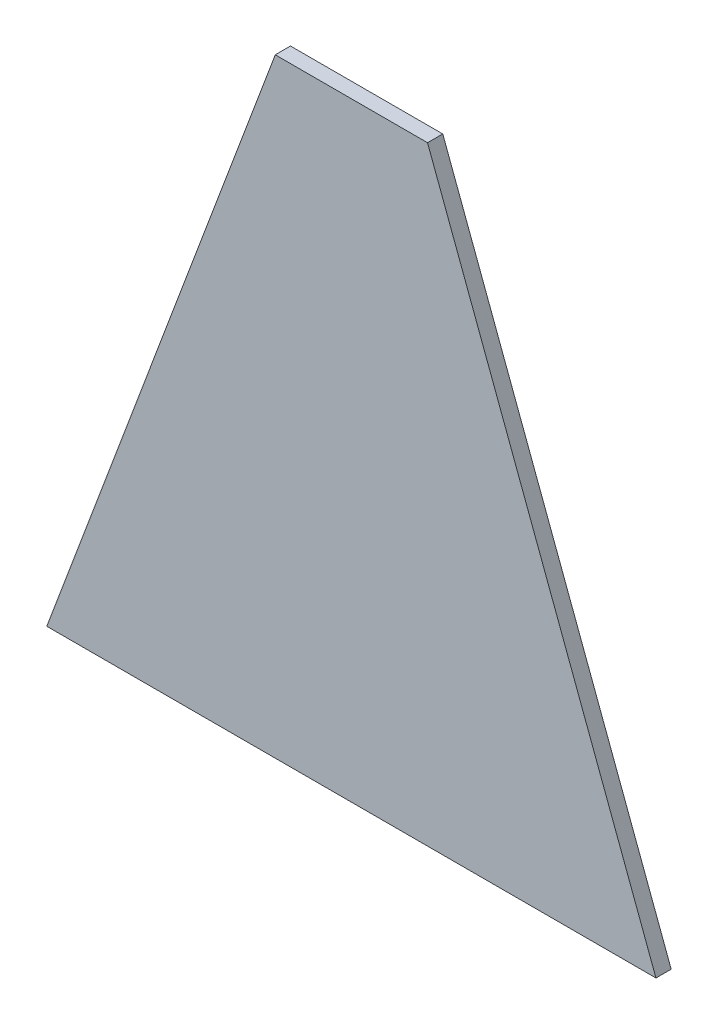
ISO-10303-21;
HEADER;
FILE_DESCRIPTION(('STEP AP214'),'2;1');
FILE_NAME('part.step','',(''),(''),'','','');
FILE_SCHEMA(('AUTOMOTIVE_DESIGN { 1 0 10303 214 1 1 1 1 }'));
ENDSEC;
DATA;
#1=APPLICATION_CONTEXT('core data for automotive mechanical design processes');
#2=APPLICATION_PROTOCOL_DEFINITION('international standard','automotive_design',2000,#1);
#3=PRODUCT_CONTEXT('',#1,'mechanical');
#4=PRODUCT('Part','Part','',(#3));
#5=PRODUCT_RELATED_PRODUCT_CATEGORY('part','',(#4));
#6=PRODUCT_DEFINITION_FORMATION('','',#4);
#7=PRODUCT_DEFINITION_CONTEXT('part definition',#1,'design');
#8=PRODUCT_DEFINITION('design','',#6,#7);
#9=PRODUCT_DEFINITION_SHAPE('','',#8);
#10=(LENGTH_UNIT() NAMED_UNIT(*) SI_UNIT(.MILLI.,.METRE.));
#11=(NAMED_UNIT(*) PLANE_ANGLE_UNIT() SI_UNIT($,.RADIAN.));
#12=(NAMED_UNIT(*) SI_UNIT($,.STERADIAN.) SOLID_ANGLE_UNIT());
#13=UNCERTAINTY_MEASURE_WITH_UNIT(LENGTH_MEASURE(1.E-05),#10,'distance_accuracy_value','');
#14=(GEOMETRIC_REPRESENTATION_CONTEXT(3) GLOBAL_UNCERTAINTY_ASSIGNED_CONTEXT((#13)) GLOBAL_UNIT_ASSIGNED_CONTEXT((#10,
#11,#12)) REPRESENTATION_CONTEXT('',''));
#15=CARTESIAN_POINT('',(0.,0.,0.));
#16=DIRECTION('',(0.,0.,1.));
#17=DIRECTION('',(1.,0.,0.));
#18=AXIS2_PLACEMENT_3D('',#15,#16,#17);
#19=CARTESIAN_POINT('',(-41.8924328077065,-80.,2.));
#20=DIRECTION('',(0.936329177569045,-0.351123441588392,0.));
#21=DIRECTION('',(0.351123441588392,0.936329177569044,0.));
#22=AXIS2_PLACEMENT_3D('',#19,#20,#21);
#23=PLANE('',#22);
#24=DIRECTION('',(-0.351123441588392,-0.936329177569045,0.));
#25=VECTOR('',#24,1.);
#26=CARTESIAN_POINT('',(-41.8924328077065,-80.,0.));
#27=LINE('',#26,#25);
#28=CARTESIAN_POINT('',(-11.8924328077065,0.,0.));
#29=VERTEX_POINT('',#28);
#30=CARTESIAN_POINT('',(-41.8924328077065,-80.,0.));
#31=VERTEX_POINT('',#30);
#32=EDGE_CURVE('E107',#29,#31,#27,.T.);
#33=ORIENTED_EDGE('',*,*,#32,.T.);
#34=DIRECTION('',(0.,0.,-1.));
#35=VECTOR('',#34,1.);
#36=CARTESIAN_POINT('',(-41.8924328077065,-80.,2.));
#37=LINE('',#36,#35);
#38=CARTESIAN_POINT('',(-41.8924328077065,-80.,2.));
#39=VERTEX_POINT('',#38);
#40=EDGE_CURVE('E11',#39,#31,#37,.T.);
#41=ORIENTED_EDGE('',*,*,#40,.F.);
#42=DIRECTION('',(-0.351123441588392,-0.936329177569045,0.));
#43=VECTOR('',#42,1.);
#44=CARTESIAN_POINT('',(-41.8924328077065,-80.,2.));
#45=LINE('',#44,#43);
#46=CARTESIAN_POINT('',(-11.8924328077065,0.,2.));
#47=VERTEX_POINT('',#46);
#48=EDGE_CURVE('E91',#47,#39,#45,.T.);
#49=ORIENTED_EDGE('',*,*,#48,.F.);
#50=DIRECTION('',(0.,0.,-1.));
#51=VECTOR('',#50,1.);
#52=CARTESIAN_POINT('',(-11.8924328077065,0.,2.));
#53=LINE('',#52,#51);
#54=EDGE_CURVE('E103',#47,#29,#53,.T.);
#55=ORIENTED_EDGE('',*,*,#54,.T.);
#56=EDGE_LOOP('',(#33,#41,#49,#55));
#57=FACE_BOUND('',#56,.T.);
#58=ADVANCED_FACE('F39',(#57),#23,.F.);
#59=CARTESIAN_POINT('',(38.1075671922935,-80.,2.));
#60=DIRECTION('',(0.,1.,0.));
#61=DIRECTION('',(0.,0.,1.));
#62=AXIS2_PLACEMENT_3D('',#59,#60,#61);
#63=PLANE('',#62);
#64=DIRECTION('',(1.,0.,0.));
#65=VECTOR('',#64,1.);
#66=CARTESIAN_POINT('',(38.1075671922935,-80.,0.));
#67=LINE('',#66,#65);
#68=CARTESIAN_POINT('',(38.1075671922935,-80.,0.));
#69=VERTEX_POINT('',#68);
#70=EDGE_CURVE('E96',#31,#69,#67,.T.);
#71=ORIENTED_EDGE('',*,*,#70,.T.);
#72=DIRECTION('',(0.,0.,-1.));
#73=VECTOR('',#72,1.);
#74=CARTESIAN_POINT('',(38.1075671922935,-80.,2.));
#75=LINE('',#74,#73);
#76=CARTESIAN_POINT('',(38.1075671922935,-80.,2.));
#77=VERTEX_POINT('',#76);
#78=EDGE_CURVE('E48',#77,#69,#75,.T.);
#79=ORIENTED_EDGE('',*,*,#78,.F.);
#80=DIRECTION('',(1.,0.,0.));
#81=VECTOR('',#80,1.);
#82=CARTESIAN_POINT('',(38.1075671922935,-80.,2.));
#83=LINE('',#82,#81);
#84=EDGE_CURVE('E86',#39,#77,#83,.T.);
#85=ORIENTED_EDGE('',*,*,#84,.F.);
#86=ORIENTED_EDGE('',*,*,#40,.T.);
#87=EDGE_LOOP('',(#71,#79,#85,#86));
#88=FACE_BOUND('',#87,.T.);
#89=ADVANCED_FACE('F95',(#88),#63,.F.);
#90=CARTESIAN_POINT('',(8.10756719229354,0.,2.));
#91=DIRECTION('',(-0.936329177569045,-0.351123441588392,0.));
#92=DIRECTION('',(0.351123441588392,-0.936329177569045,0.));
#93=AXIS2_PLACEMENT_3D('',#90,#91,#92);
#94=PLANE('',#93);
#95=DIRECTION('',(-0.351123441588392,0.936329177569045,0.));
#96=VECTOR('',#95,1.);
#97=CARTESIAN_POINT('',(8.10756719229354,0.,0.));
#98=LINE('',#97,#96);
#99=CARTESIAN_POINT('',(8.10756719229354,0.,0.));
#100=VERTEX_POINT('',#99);
#101=EDGE_CURVE('E73',#69,#100,#98,.T.);
#102=ORIENTED_EDGE('',*,*,#101,.T.);
#103=DIRECTION('',(0.,0.,-1.));
#104=VECTOR('',#103,1.);
#105=CARTESIAN_POINT('',(8.10756719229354,0.,2.));
#106=LINE('',#105,#104);
#107=CARTESIAN_POINT('',(8.10756719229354,0.,2.));
#108=VERTEX_POINT('',#107);
#109=EDGE_CURVE('E98',#108,#100,#106,.T.);
#110=ORIENTED_EDGE('',*,*,#109,.F.);
#111=DIRECTION('',(-0.351123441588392,0.936329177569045,0.));
#112=VECTOR('',#111,1.);
#113=CARTESIAN_POINT('',(8.10756719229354,0.,2.));
#114=LINE('',#113,#112);
#115=EDGE_CURVE('E89',#77,#108,#114,.T.);
#116=ORIENTED_EDGE('',*,*,#115,.F.);
#117=ORIENTED_EDGE('',*,*,#78,.T.);
#118=EDGE_LOOP('',(#102,#110,#116,#117));
#119=FACE_BOUND('',#118,.T.);
#120=ADVANCED_FACE('F99',(#119),#94,.F.);
#121=CARTESIAN_POINT('',(-11.8924328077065,0.,2.));
#122=DIRECTION('',(0.,-1.,0.));
#123=DIRECTION('',(0.,0.,-1.));
#124=AXIS2_PLACEMENT_3D('',#121,#122,#123);
#125=PLANE('',#124);
#126=DIRECTION('',(-1.,0.,0.));
#127=VECTOR('',#126,1.);
#128=CARTESIAN_POINT('',(-11.8924328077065,0.,0.));
#129=LINE('',#128,#127);
#130=EDGE_CURVE('E79',#100,#29,#129,.T.);
#131=ORIENTED_EDGE('',*,*,#130,.T.);
#132=ORIENTED_EDGE('',*,*,#54,.F.);
#133=DIRECTION('',(-1.,0.,0.));
#134=VECTOR('',#133,1.);
#135=CARTESIAN_POINT('',(-11.8924328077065,0.,2.));
#136=LINE('',#135,#134);
#137=EDGE_CURVE('E56',#108,#47,#136,.T.);
#138=ORIENTED_EDGE('',*,*,#137,.F.);
#139=ORIENTED_EDGE('',*,*,#109,.T.);
#140=EDGE_LOOP('',(#131,#132,#138,#139));
#141=FACE_BOUND('',#140,.T.);
#142=ADVANCED_FACE('F120',(#141),#125,.F.);
#143=CARTESIAN_POINT('',(0.,0.,2.));
#144=DIRECTION('',(0.,0.,-1.));
#145=DIRECTION('',(-1.,0.,0.));
#146=AXIS2_PLACEMENT_3D('',#143,#144,#145);
#147=PLANE('',#146);
#148=ORIENTED_EDGE('',*,*,#48,.T.);
#149=ORIENTED_EDGE('',*,*,#84,.T.);
#150=ORIENTED_EDGE('',*,*,#115,.T.);
#151=ORIENTED_EDGE('',*,*,#137,.T.);
#152=EDGE_LOOP('',(#148,#149,#150,#151));
#153=FACE_BOUND('',#152,.T.);
#154=ADVANCED_FACE('F87',(#153),#147,.F.);
#155=CARTESIAN_POINT('',(0.,0.,0.));
#156=DIRECTION('',(0.,0.,-1.));
#157=DIRECTION('',(-1.,0.,0.));
#158=AXIS2_PLACEMENT_3D('',#155,#156,#157);
#159=PLANE('',#158);
#160=ORIENTED_EDGE('',*,*,#32,.F.);
#161=ORIENTED_EDGE('',*,*,#130,.F.);
#162=ORIENTED_EDGE('',*,*,#101,.F.);
#163=ORIENTED_EDGE('',*,*,#70,.F.);
#164=EDGE_LOOP('',(#160,#161,#162,#163));
#165=FACE_BOUND('',#164,.T.);
#166=ADVANCED_FACE('F123',(#165),#159,.T.);
#167=CLOSED_SHELL('',(#58,#89,#120,#142,#154,#166));
#168=MANIFOLD_SOLID_BREP('B2',#167);
#169=ADVANCED_BREP_SHAPE_REPRESENTATION('',(#18,#168),#14);
#170=SHAPE_DEFINITION_REPRESENTATION(#9,#169);
ENDSEC;
END-ISO-10303-21;
